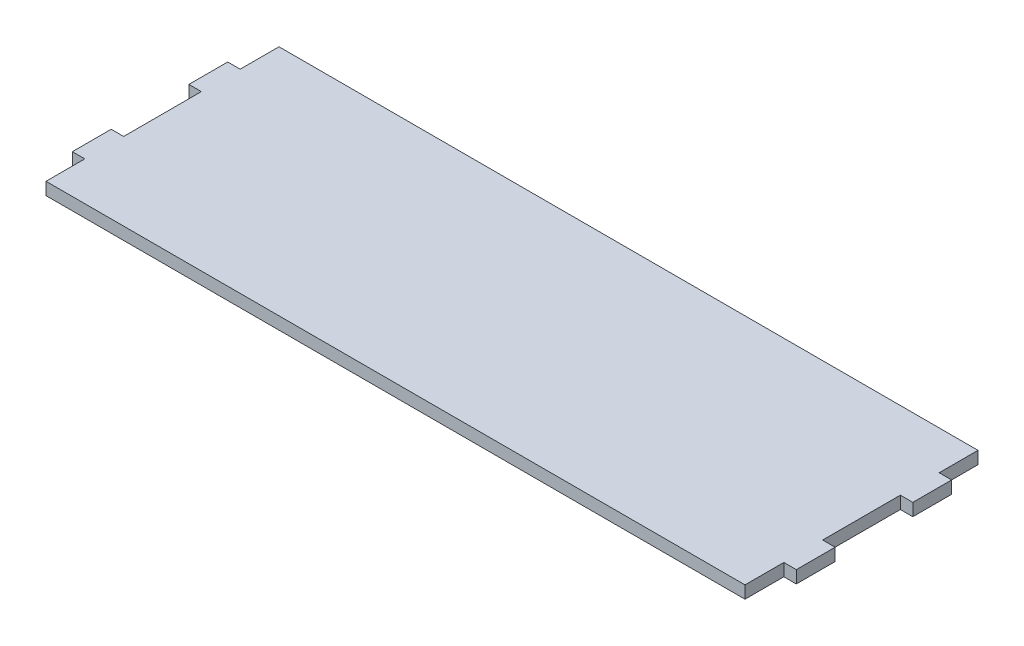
ISO-10303-21;
HEADER;
FILE_DESCRIPTION(('STEP AP214'),'2;1');
FILE_NAME('part.step','',(''),(''),'','','');
FILE_SCHEMA(('AUTOMOTIVE_DESIGN { 1 0 10303 214 1 1 1 1 }'));
ENDSEC;
DATA;
#1=APPLICATION_CONTEXT('core data for automotive mechanical design processes');
#2=APPLICATION_PROTOCOL_DEFINITION('international standard','automotive_design',2000,#1);
#3=PRODUCT_CONTEXT('',#1,'mechanical');
#4=PRODUCT('Part','Part','',(#3));
#5=PRODUCT_RELATED_PRODUCT_CATEGORY('part','',(#4));
#6=PRODUCT_DEFINITION_FORMATION('','',#4);
#7=PRODUCT_DEFINITION_CONTEXT('part definition',#1,'design');
#8=PRODUCT_DEFINITION('design','',#6,#7);
#9=PRODUCT_DEFINITION_SHAPE('','',#8);
#10=(LENGTH_UNIT() NAMED_UNIT(*) SI_UNIT(.MILLI.,.METRE.));
#11=(NAMED_UNIT(*) PLANE_ANGLE_UNIT() SI_UNIT($,.RADIAN.));
#12=(NAMED_UNIT(*) SI_UNIT($,.STERADIAN.) SOLID_ANGLE_UNIT());
#13=UNCERTAINTY_MEASURE_WITH_UNIT(LENGTH_MEASURE(1.E-05),#10,'distance_accuracy_value','');
#14=(GEOMETRIC_REPRESENTATION_CONTEXT(3) GLOBAL_UNCERTAINTY_ASSIGNED_CONTEXT((#13)) GLOBAL_UNIT_ASSIGNED_CONTEXT((#10,
#11,#12)) REPRESENTATION_CONTEXT('',''));
#15=CARTESIAN_POINT('',(0.,0.,0.));
#16=DIRECTION('',(0.,0.,1.));
#17=DIRECTION('',(1.,0.,0.));
#18=AXIS2_PLACEMENT_3D('',#15,#16,#17);
#19=CARTESIAN_POINT('',(-59.3719908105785,16.30000042,-260.123418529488));
#20=DIRECTION('',(1.,0.,0.));
#21=DIRECTION('',(0.,0.,-1.));
#22=AXIS2_PLACEMENT_3D('',#19,#20,#21);
#23=PLANE('',#22);
#24=DIRECTION('',(0.,0.,1.));
#25=VECTOR('',#24,1.);
#26=CARTESIAN_POINT('',(-59.3719908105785,0.,-260.123418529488));
#27=LINE('',#26,#25);
#28=CARTESIAN_POINT('',(-59.3719908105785,0.,-260.123418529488));
#29=VERTEX_POINT('',#28);
#30=CARTESIAN_POINT('',(-59.3719908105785,0.,-209.323418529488));
#31=VERTEX_POINT('',#30);
#32=EDGE_CURVE('E201',#29,#31,#27,.T.);
#33=ORIENTED_EDGE('',*,*,#32,.T.);
#34=DIRECTION('',(0.,-1.,0.));
#35=VECTOR('',#34,1.);
#36=CARTESIAN_POINT('',(-59.3719908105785,16.30000042,-209.323418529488));
#37=LINE('',#36,#35);
#38=CARTESIAN_POINT('',(-59.3719908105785,16.30000042,-209.323418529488));
#39=VERTEX_POINT('',#38);
#40=EDGE_CURVE('E11',#39,#31,#37,.T.);
#41=ORIENTED_EDGE('',*,*,#40,.F.);
#42=DIRECTION('',(0.,0.,1.));
#43=VECTOR('',#42,1.);
#44=CARTESIAN_POINT('',(-59.3719908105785,16.30000042,-260.123418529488));
#45=LINE('',#44,#43);
#46=CARTESIAN_POINT('',(-59.3719908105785,16.30000042,-260.123418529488));
#47=VERTEX_POINT('',#46);
#48=EDGE_CURVE('E239',#47,#39,#45,.T.);
#49=ORIENTED_EDGE('',*,*,#48,.F.);
#50=DIRECTION('',(0.,-1.,0.));
#51=VECTOR('',#50,1.);
#52=CARTESIAN_POINT('',(-59.3719908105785,16.30000042,-260.123418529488));
#53=LINE('',#52,#51);
#54=EDGE_CURVE('E197',#47,#29,#53,.T.);
#55=ORIENTED_EDGE('',*,*,#54,.T.);
#56=EDGE_LOOP('',(#33,#41,#49,#55));
#57=FACE_BOUND('',#56,.T.);
#58=ADVANCED_FACE('F33',(#57),#23,.F.);
#59=CARTESIAN_POINT('',(-59.3719908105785,16.30000042,-209.323418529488));
#60=DIRECTION('',(0.,0.,1.));
#61=DIRECTION('',(1.,0.,0.));
#62=AXIS2_PLACEMENT_3D('',#59,#60,#61);
#63=PLANE('',#62);
#64=DIRECTION('',(-1.,0.,0.));
#65=VECTOR('',#64,1.);
#66=CARTESIAN_POINT('',(-59.3719908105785,0.,-209.323418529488));
#67=LINE('',#66,#65);
#68=CARTESIAN_POINT('',(-75.6719912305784,0.,-209.323418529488));
#69=VERTEX_POINT('',#68);
#70=EDGE_CURVE('E204',#31,#69,#67,.T.);
#71=ORIENTED_EDGE('',*,*,#70,.T.);
#72=DIRECTION('',(0.,-1.,0.));
#73=VECTOR('',#72,1.);
#74=CARTESIAN_POINT('',(-75.6719912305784,16.30000042,-209.323418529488));
#75=LINE('',#74,#73);
#76=CARTESIAN_POINT('',(-75.6719912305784,16.30000042,-209.323418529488));
#77=VERTEX_POINT('',#76);
#78=EDGE_CURVE('E41',#77,#69,#75,.T.);
#79=ORIENTED_EDGE('',*,*,#78,.F.);
#80=DIRECTION('',(-1.,0.,0.));
#81=VECTOR('',#80,1.);
#82=CARTESIAN_POINT('',(-59.3719908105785,16.30000042,-209.323418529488));
#83=LINE('',#82,#81);
#84=EDGE_CURVE('E128',#39,#77,#83,.T.);
#85=ORIENTED_EDGE('',*,*,#84,.F.);
#86=ORIENTED_EDGE('',*,*,#40,.T.);
#87=EDGE_LOOP('',(#71,#79,#85,#86));
#88=FACE_BOUND('',#87,.T.);
#89=ADVANCED_FACE('F357',(#88),#63,.F.);
#90=CARTESIAN_POINT('',(-75.6719912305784,16.30000042,-209.323418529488));
#91=DIRECTION('',(1.,0.,0.));
#92=DIRECTION('',(0.,0.,-1.));
#93=AXIS2_PLACEMENT_3D('',#90,#91,#92);
#94=PLANE('',#93);
#95=DIRECTION('',(0.,0.,1.));
#96=VECTOR('',#95,1.);
#97=CARTESIAN_POINT('',(-75.6719912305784,0.,-209.323418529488));
#98=LINE('',#97,#96);
#99=CARTESIAN_POINT('',(-75.6719912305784,0.,-158.523418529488));
#100=VERTEX_POINT('',#99);
#101=EDGE_CURVE('E206',#69,#100,#98,.T.);
#102=ORIENTED_EDGE('',*,*,#101,.T.);
#103=DIRECTION('',(0.,-1.,0.));
#104=VECTOR('',#103,1.);
#105=CARTESIAN_POINT('',(-75.6719912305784,16.30000042,-158.523418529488));
#106=LINE('',#105,#104);
#107=CARTESIAN_POINT('',(-75.6719912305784,16.30000042,-158.523418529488));
#108=VERTEX_POINT('',#107);
#109=EDGE_CURVE('E282',#108,#100,#106,.T.);
#110=ORIENTED_EDGE('',*,*,#109,.F.);
#111=DIRECTION('',(0.,0.,1.));
#112=VECTOR('',#111,1.);
#113=CARTESIAN_POINT('',(-75.6719912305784,16.30000042,-209.323418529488));
#114=LINE('',#113,#112);
#115=EDGE_CURVE('E290',#77,#108,#114,.T.);
#116=ORIENTED_EDGE('',*,*,#115,.F.);
#117=ORIENTED_EDGE('',*,*,#78,.T.);
#118=EDGE_LOOP('',(#102,#110,#116,#117));
#119=FACE_BOUND('',#118,.T.);
#120=ADVANCED_FACE('F288',(#119),#94,.F.);
#121=CARTESIAN_POINT('',(-75.6719912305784,16.30000042,-158.523418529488));
#122=DIRECTION('',(0.,0.,-1.));
#123=DIRECTION('',(-1.,0.,0.));
#124=AXIS2_PLACEMENT_3D('',#121,#122,#123);
#125=PLANE('',#124);
#126=DIRECTION('',(1.,0.,0.));
#127=VECTOR('',#126,1.);
#128=CARTESIAN_POINT('',(-75.6719912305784,0.,-158.523418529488));
#129=LINE('',#128,#127);
#130=CARTESIAN_POINT('',(-59.3719908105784,0.,-158.523418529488));
#131=VERTEX_POINT('',#130);
#132=EDGE_CURVE('E208',#100,#131,#129,.T.);
#133=ORIENTED_EDGE('',*,*,#132,.T.);
#134=DIRECTION('',(0.,-1.,0.));
#135=VECTOR('',#134,1.);
#136=CARTESIAN_POINT('',(-59.3719908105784,16.30000042,-158.523418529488));
#137=LINE('',#136,#135);
#138=CARTESIAN_POINT('',(-59.3719908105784,16.30000042,-158.523418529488));
#139=VERTEX_POINT('',#138);
#140=EDGE_CURVE('E279',#139,#131,#137,.T.);
#141=ORIENTED_EDGE('',*,*,#140,.F.);
#142=DIRECTION('',(1.,0.,0.));
#143=VECTOR('',#142,1.);
#144=CARTESIAN_POINT('',(-75.6719912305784,16.30000042,-158.523418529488));
#145=LINE('',#144,#143);
#146=EDGE_CURVE('E308',#108,#139,#145,.T.);
#147=ORIENTED_EDGE('',*,*,#146,.F.);
#148=ORIENTED_EDGE('',*,*,#109,.T.);
#149=EDGE_LOOP('',(#133,#141,#147,#148));
#150=FACE_BOUND('',#149,.T.);
#151=ADVANCED_FACE('F299',(#150),#125,.F.);
#152=CARTESIAN_POINT('',(-59.3719908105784,16.30000042,-158.523418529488));
#153=DIRECTION('',(1.,0.,0.));
#154=DIRECTION('',(0.,0.,-1.));
#155=AXIS2_PLACEMENT_3D('',#152,#153,#154);
#156=PLANE('',#155);
#157=DIRECTION('',(0.,0.,1.));
#158=VECTOR('',#157,1.);
#159=CARTESIAN_POINT('',(-59.3719908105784,0.,-158.523418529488));
#160=LINE('',#159,#158);
#161=CARTESIAN_POINT('',(-59.3719908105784,0.,-56.9234185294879));
#162=VERTEX_POINT('',#161);
#163=EDGE_CURVE('E210',#131,#162,#160,.T.);
#164=ORIENTED_EDGE('',*,*,#163,.T.);
#165=DIRECTION('',(0.,-1.,0.));
#166=VECTOR('',#165,1.);
#167=CARTESIAN_POINT('',(-59.3719908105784,16.30000042,-56.9234185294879));
#168=LINE('',#167,#166);
#169=CARTESIAN_POINT('',(-59.3719908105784,16.30000042,-56.9234185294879));
#170=VERTEX_POINT('',#169);
#171=EDGE_CURVE('E276',#170,#162,#168,.T.);
#172=ORIENTED_EDGE('',*,*,#171,.F.);
#173=DIRECTION('',(0.,0.,1.));
#174=VECTOR('',#173,1.);
#175=CARTESIAN_POINT('',(-59.3719908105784,16.30000042,-158.523418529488));
#176=LINE('',#175,#174);
#177=EDGE_CURVE('E305',#139,#170,#176,.T.);
#178=ORIENTED_EDGE('',*,*,#177,.F.);
#179=ORIENTED_EDGE('',*,*,#140,.T.);
#180=EDGE_LOOP('',(#164,#172,#178,#179));
#181=FACE_BOUND('',#180,.T.);
#182=ADVANCED_FACE('F303',(#181),#156,.F.);
#183=CARTESIAN_POINT('',(-75.6719912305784,16.30000042,-56.9234185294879));
#184=DIRECTION('',(0.,0.,1.));
#185=DIRECTION('',(1.,0.,0.));
#186=AXIS2_PLACEMENT_3D('',#183,#184,#185);
#187=PLANE('',#186);
#188=DIRECTION('',(-1.,0.,0.));
#189=VECTOR('',#188,1.);
#190=CARTESIAN_POINT('',(-75.6719912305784,0.,-56.9234185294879));
#191=LINE('',#190,#189);
#192=CARTESIAN_POINT('',(-75.6719912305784,0.,-56.9234185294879));
#193=VERTEX_POINT('',#192);
#194=EDGE_CURVE('E212',#162,#193,#191,.T.);
#195=ORIENTED_EDGE('',*,*,#194,.T.);
#196=DIRECTION('',(0.,-1.,0.));
#197=VECTOR('',#196,1.);
#198=CARTESIAN_POINT('',(-75.6719912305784,16.30000042,-56.9234185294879));
#199=LINE('',#198,#197);
#200=CARTESIAN_POINT('',(-75.6719912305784,16.30000042,-56.9234185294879));
#201=VERTEX_POINT('',#200);
#202=EDGE_CURVE('E273',#201,#193,#199,.T.);
#203=ORIENTED_EDGE('',*,*,#202,.F.);
#204=DIRECTION('',(-1.,0.,0.));
#205=VECTOR('',#204,1.);
#206=CARTESIAN_POINT('',(-75.6719912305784,16.30000042,-56.9234185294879));
#207=LINE('',#206,#205);
#208=EDGE_CURVE('E307',#170,#201,#207,.T.);
#209=ORIENTED_EDGE('',*,*,#208,.F.);
#210=ORIENTED_EDGE('',*,*,#171,.T.);
#211=EDGE_LOOP('',(#195,#203,#209,#210));
#212=FACE_BOUND('',#211,.T.);
#213=ADVANCED_FACE('F370',(#212),#187,.F.);
#214=CARTESIAN_POINT('',(-75.6719912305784,16.30000042,-6.12341852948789));
#215=DIRECTION('',(1.,0.,0.));
#216=DIRECTION('',(0.,0.,-1.));
#217=AXIS2_PLACEMENT_3D('',#214,#215,#216);
#218=PLANE('',#217);
#219=DIRECTION('',(0.,0.,1.));
#220=VECTOR('',#219,1.);
#221=CARTESIAN_POINT('',(-75.6719912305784,0.,-6.12341852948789));
#222=LINE('',#221,#220);
#223=CARTESIAN_POINT('',(-75.6719912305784,0.,-6.12341852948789));
#224=VERTEX_POINT('',#223);
#225=EDGE_CURVE('E214',#193,#224,#222,.T.);
#226=ORIENTED_EDGE('',*,*,#225,.T.);
#227=DIRECTION('',(0.,-1.,0.));
#228=VECTOR('',#227,1.);
#229=CARTESIAN_POINT('',(-75.6719912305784,16.30000042,-6.12341852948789));
#230=LINE('',#229,#228);
#231=CARTESIAN_POINT('',(-75.6719912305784,16.30000042,-6.12341852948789));
#232=VERTEX_POINT('',#231);
#233=EDGE_CURVE('E270',#232,#224,#230,.T.);
#234=ORIENTED_EDGE('',*,*,#233,.F.);
#235=DIRECTION('',(0.,0.,1.));
#236=VECTOR('',#235,1.);
#237=CARTESIAN_POINT('',(-75.6719912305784,16.30000042,-6.12341852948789));
#238=LINE('',#237,#236);
#239=EDGE_CURVE('E310',#201,#232,#238,.T.);
#240=ORIENTED_EDGE('',*,*,#239,.F.);
#241=ORIENTED_EDGE('',*,*,#202,.T.);
#242=EDGE_LOOP('',(#226,#234,#240,#241));
#243=FACE_BOUND('',#242,.T.);
#244=ADVANCED_FACE('F373',(#243),#218,.F.);
#245=CARTESIAN_POINT('',(-59.3719908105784,16.30000042,-6.12341852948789));
#246=DIRECTION('',(0.,0.,-1.));
#247=DIRECTION('',(-1.,0.,0.));
#248=AXIS2_PLACEMENT_3D('',#245,#246,#247);
#249=PLANE('',#248);
#250=DIRECTION('',(1.,0.,0.));
#251=VECTOR('',#250,1.);
#252=CARTESIAN_POINT('',(-59.3719908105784,0.,-6.12341852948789));
#253=LINE('',#252,#251);
#254=CARTESIAN_POINT('',(-59.3719908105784,0.,-6.12341852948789));
#255=VERTEX_POINT('',#254);
#256=EDGE_CURVE('E216',#224,#255,#253,.T.);
#257=ORIENTED_EDGE('',*,*,#256,.T.);
#258=DIRECTION('',(0.,-1.,0.));
#259=VECTOR('',#258,1.);
#260=CARTESIAN_POINT('',(-59.3719908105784,16.30000042,-6.12341852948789));
#261=LINE('',#260,#259);
#262=CARTESIAN_POINT('',(-59.3719908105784,16.30000042,-6.12341852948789));
#263=VERTEX_POINT('',#262);
#264=EDGE_CURVE('E267',#263,#255,#261,.T.);
#265=ORIENTED_EDGE('',*,*,#264,.F.);
#266=DIRECTION('',(1.,0.,0.));
#267=VECTOR('',#266,1.);
#268=CARTESIAN_POINT('',(-59.3719908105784,16.30000042,-6.12341852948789));
#269=LINE('',#268,#267);
#270=EDGE_CURVE('E316',#232,#263,#269,.T.);
#271=ORIENTED_EDGE('',*,*,#270,.F.);
#272=ORIENTED_EDGE('',*,*,#233,.T.);
#273=EDGE_LOOP('',(#257,#265,#271,#272));
#274=FACE_BOUND('',#273,.T.);
#275=ADVANCED_FACE('F377',(#274),#249,.F.);
#276=CARTESIAN_POINT('',(-59.3719908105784,16.30000042,-6.12341852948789));
#277=DIRECTION('',(1.,0.,0.));
#278=DIRECTION('',(0.,0.,-1.));
#279=AXIS2_PLACEMENT_3D('',#276,#277,#278);
#280=PLANE('',#279);
#281=DIRECTION('',(0.,0.,1.));
#282=VECTOR('',#281,1.);
#283=CARTESIAN_POINT('',(-59.3719908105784,0.,-6.12341852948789));
#284=LINE('',#283,#282);
#285=CARTESIAN_POINT('',(-59.3719908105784,0.,44.6765814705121));
#286=VERTEX_POINT('',#285);
#287=EDGE_CURVE('E218',#255,#286,#284,.T.);
#288=ORIENTED_EDGE('',*,*,#287,.T.);
#289=DIRECTION('',(0.,-1.,0.));
#290=VECTOR('',#289,1.);
#291=CARTESIAN_POINT('',(-59.3719908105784,16.30000042,44.6765814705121));
#292=LINE('',#291,#290);
#293=CARTESIAN_POINT('',(-59.3719908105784,16.30000042,44.6765814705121));
#294=VERTEX_POINT('',#293);
#295=EDGE_CURVE('E264',#294,#286,#292,.T.);
#296=ORIENTED_EDGE('',*,*,#295,.F.);
#297=DIRECTION('',(0.,0.,1.));
#298=VECTOR('',#297,1.);
#299=CARTESIAN_POINT('',(-59.3719908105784,16.30000042,-6.12341852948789));
#300=LINE('',#299,#298);
#301=EDGE_CURVE('E318',#263,#294,#300,.T.);
#302=ORIENTED_EDGE('',*,*,#301,.F.);
#303=ORIENTED_EDGE('',*,*,#264,.T.);
#304=EDGE_LOOP('',(#288,#296,#302,#303));
#305=FACE_BOUND('',#304,.T.);
#306=ADVANCED_FACE('F381',(#305),#280,.F.);
#307=CARTESIAN_POINT('',(-59.3719908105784,16.30000042,44.6765814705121));
#308=DIRECTION('',(0.,0.,-1.));
#309=DIRECTION('',(-1.,0.,0.));
#310=AXIS2_PLACEMENT_3D('',#307,#308,#309);
#311=PLANE('',#310);
#312=DIRECTION('',(1.,0.,0.));
#313=VECTOR('',#312,1.);
#314=CARTESIAN_POINT('',(-59.3719908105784,0.,44.6765814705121));
#315=LINE('',#314,#313);
#316=CARTESIAN_POINT('',(855.028009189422,0.,44.6765814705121));
#317=VERTEX_POINT('',#316);
#318=EDGE_CURVE('E220',#286,#317,#315,.T.);
#319=ORIENTED_EDGE('',*,*,#318,.T.);
#320=DIRECTION('',(0.,-1.,0.));
#321=VECTOR('',#320,1.);
#322=CARTESIAN_POINT('',(855.028009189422,16.30000042,44.6765814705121));
#323=LINE('',#322,#321);
#324=CARTESIAN_POINT('',(855.028009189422,16.30000042,44.6765814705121));
#325=VERTEX_POINT('',#324);
#326=EDGE_CURVE('E261',#325,#317,#323,.T.);
#327=ORIENTED_EDGE('',*,*,#326,.F.);
#328=DIRECTION('',(1.,0.,0.));
#329=VECTOR('',#328,1.);
#330=CARTESIAN_POINT('',(-59.3719908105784,16.30000042,44.6765814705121));
#331=LINE('',#330,#329);
#332=EDGE_CURVE('E320',#294,#325,#331,.T.);
#333=ORIENTED_EDGE('',*,*,#332,.F.);
#334=ORIENTED_EDGE('',*,*,#295,.T.);
#335=EDGE_LOOP('',(#319,#327,#333,#334));
#336=FACE_BOUND('',#335,.T.);
#337=ADVANCED_FACE('F385',(#336),#311,.F.);
#338=CARTESIAN_POINT('',(855.028009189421,16.30000042,-6.123418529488));
#339=DIRECTION('',(-1.,0.,0.));
#340=DIRECTION('',(0.,0.,1.));
#341=AXIS2_PLACEMENT_3D('',#338,#339,#340);
#342=PLANE('',#341);
#343=DIRECTION('',(0.,0.,-1.));
#344=VECTOR('',#343,1.);
#345=CARTESIAN_POINT('',(855.028009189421,0.,-6.123418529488));
#346=LINE('',#345,#344);
#347=CARTESIAN_POINT('',(855.028009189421,0.,-6.123418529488));
#348=VERTEX_POINT('',#347);
#349=EDGE_CURVE('E222',#317,#348,#346,.T.);
#350=ORIENTED_EDGE('',*,*,#349,.T.);
#351=DIRECTION('',(0.,-1.,0.));
#352=VECTOR('',#351,1.);
#353=CARTESIAN_POINT('',(855.028009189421,16.30000042,-6.123418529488));
#354=LINE('',#353,#352);
#355=CARTESIAN_POINT('',(855.028009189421,16.30000042,-6.123418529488));
#356=VERTEX_POINT('',#355);
#357=EDGE_CURVE('E258',#356,#348,#354,.T.);
#358=ORIENTED_EDGE('',*,*,#357,.F.);
#359=DIRECTION('',(0.,0.,-1.));
#360=VECTOR('',#359,1.);
#361=CARTESIAN_POINT('',(855.028009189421,16.30000042,-6.123418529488));
#362=LINE('',#361,#360);
#363=EDGE_CURVE('E322',#325,#356,#362,.T.);
#364=ORIENTED_EDGE('',*,*,#363,.F.);
#365=ORIENTED_EDGE('',*,*,#326,.T.);
#366=EDGE_LOOP('',(#350,#358,#364,#365));
#367=FACE_BOUND('',#366,.T.);
#368=ADVANCED_FACE('F389',(#367),#342,.F.);
#369=CARTESIAN_POINT('',(855.028009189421,16.30000042,-6.123418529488));
#370=DIRECTION('',(0.,0.,-1.));
#371=DIRECTION('',(-1.,0.,0.));
#372=AXIS2_PLACEMENT_3D('',#369,#370,#371);
#373=PLANE('',#372);
#374=DIRECTION('',(1.,0.,0.));
#375=VECTOR('',#374,1.);
#376=CARTESIAN_POINT('',(855.028009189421,0.,-6.123418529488));
#377=LINE('',#376,#375);
#378=CARTESIAN_POINT('',(871.328009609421,0.,-6.123418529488));
#379=VERTEX_POINT('',#378);
#380=EDGE_CURVE('E224',#348,#379,#377,.T.);
#381=ORIENTED_EDGE('',*,*,#380,.T.);
#382=DIRECTION('',(0.,-1.,0.));
#383=VECTOR('',#382,1.);
#384=CARTESIAN_POINT('',(871.328009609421,16.30000042,-6.123418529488));
#385=LINE('',#384,#383);
#386=CARTESIAN_POINT('',(871.328009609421,16.30000042,-6.123418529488));
#387=VERTEX_POINT('',#386);
#388=EDGE_CURVE('E255',#387,#379,#385,.T.);
#389=ORIENTED_EDGE('',*,*,#388,.F.);
#390=DIRECTION('',(1.,0.,0.));
#391=VECTOR('',#390,1.);
#392=CARTESIAN_POINT('',(855.028009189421,16.30000042,-6.123418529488));
#393=LINE('',#392,#391);
#394=EDGE_CURVE('E324',#356,#387,#393,.T.);
#395=ORIENTED_EDGE('',*,*,#394,.F.);
#396=ORIENTED_EDGE('',*,*,#357,.T.);
#397=EDGE_LOOP('',(#381,#389,#395,#396));
#398=FACE_BOUND('',#397,.T.);
#399=ADVANCED_FACE('F393',(#398),#373,.F.);
#400=CARTESIAN_POINT('',(871.328009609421,16.30000042,-6.123418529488));
#401=DIRECTION('',(-1.,0.,0.));
#402=DIRECTION('',(0.,0.,1.));
#403=AXIS2_PLACEMENT_3D('',#400,#401,#402);
#404=PLANE('',#403);
#405=DIRECTION('',(0.,0.,-1.));
#406=VECTOR('',#405,1.);
#407=CARTESIAN_POINT('',(871.328009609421,0.,-6.123418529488));
#408=LINE('',#407,#406);
#409=CARTESIAN_POINT('',(871.328009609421,0.,-56.923418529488));
#410=VERTEX_POINT('',#409);
#411=EDGE_CURVE('E226',#379,#410,#408,.T.);
#412=ORIENTED_EDGE('',*,*,#411,.T.);
#413=DIRECTION('',(0.,-1.,0.));
#414=VECTOR('',#413,1.);
#415=CARTESIAN_POINT('',(871.328009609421,16.30000042,-56.923418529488));
#416=LINE('',#415,#414);
#417=CARTESIAN_POINT('',(871.328009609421,16.30000042,-56.923418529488));
#418=VERTEX_POINT('',#417);
#419=EDGE_CURVE('E252',#418,#410,#416,.T.);
#420=ORIENTED_EDGE('',*,*,#419,.F.);
#421=DIRECTION('',(0.,0.,-1.));
#422=VECTOR('',#421,1.);
#423=CARTESIAN_POINT('',(871.328009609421,16.30000042,-6.123418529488));
#424=LINE('',#423,#422);
#425=EDGE_CURVE('E326',#387,#418,#424,.T.);
#426=ORIENTED_EDGE('',*,*,#425,.F.);
#427=ORIENTED_EDGE('',*,*,#388,.T.);
#428=EDGE_LOOP('',(#412,#420,#426,#427));
#429=FACE_BOUND('',#428,.T.);
#430=ADVANCED_FACE('F397',(#429),#404,.F.);
#431=CARTESIAN_POINT('',(871.328009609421,16.30000042,-56.923418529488));
#432=DIRECTION('',(0.,0.,1.));
#433=DIRECTION('',(1.,0.,0.));
#434=AXIS2_PLACEMENT_3D('',#431,#432,#433);
#435=PLANE('',#434);
#436=DIRECTION('',(-1.,0.,0.));
#437=VECTOR('',#436,1.);
#438=CARTESIAN_POINT('',(871.328009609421,0.,-56.923418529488));
#439=LINE('',#438,#437);
#440=CARTESIAN_POINT('',(855.028009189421,0.,-56.923418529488));
#441=VERTEX_POINT('',#440);
#442=EDGE_CURVE('E228',#410,#441,#439,.T.);
#443=ORIENTED_EDGE('',*,*,#442,.T.);
#444=DIRECTION('',(0.,-1.,0.));
#445=VECTOR('',#444,1.);
#446=CARTESIAN_POINT('',(855.028009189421,16.30000042,-56.923418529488));
#447=LINE('',#446,#445);
#448=CARTESIAN_POINT('',(855.028009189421,16.30000042,-56.923418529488));
#449=VERTEX_POINT('',#448);
#450=EDGE_CURVE('E249',#449,#441,#447,.T.);
#451=ORIENTED_EDGE('',*,*,#450,.F.);
#452=DIRECTION('',(-1.,0.,0.));
#453=VECTOR('',#452,1.);
#454=CARTESIAN_POINT('',(871.328009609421,16.30000042,-56.923418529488));
#455=LINE('',#454,#453);
#456=EDGE_CURVE('E328',#418,#449,#455,.T.);
#457=ORIENTED_EDGE('',*,*,#456,.F.);
#458=ORIENTED_EDGE('',*,*,#419,.T.);
#459=EDGE_LOOP('',(#443,#451,#457,#458));
#460=FACE_BOUND('',#459,.T.);
#461=ADVANCED_FACE('F401',(#460),#435,.F.);
#462=CARTESIAN_POINT('',(855.028009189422,16.30000042,-158.523418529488));
#463=DIRECTION('',(-1.,0.,0.));
#464=DIRECTION('',(0.,0.,1.));
#465=AXIS2_PLACEMENT_3D('',#462,#463,#464);
#466=PLANE('',#465);
#467=DIRECTION('',(0.,0.,-1.));
#468=VECTOR('',#467,1.);
#469=CARTESIAN_POINT('',(855.028009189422,0.,-158.523418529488));
#470=LINE('',#469,#468);
#471=CARTESIAN_POINT('',(855.028009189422,0.,-158.523418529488));
#472=VERTEX_POINT('',#471);
#473=EDGE_CURVE('E230',#441,#472,#470,.T.);
#474=ORIENTED_EDGE('',*,*,#473,.T.);
#475=DIRECTION('',(0.,-1.,0.));
#476=VECTOR('',#475,1.);
#477=CARTESIAN_POINT('',(855.028009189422,16.30000042,-158.523418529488));
#478=LINE('',#477,#476);
#479=CARTESIAN_POINT('',(855.028009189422,16.30000042,-158.523418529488));
#480=VERTEX_POINT('',#479);
#481=EDGE_CURVE('E246',#480,#472,#478,.T.);
#482=ORIENTED_EDGE('',*,*,#481,.F.);
#483=DIRECTION('',(0.,0.,-1.));
#484=VECTOR('',#483,1.);
#485=CARTESIAN_POINT('',(855.028009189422,16.30000042,-158.523418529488));
#486=LINE('',#485,#484);
#487=EDGE_CURVE('E330',#449,#480,#486,.T.);
#488=ORIENTED_EDGE('',*,*,#487,.F.);
#489=ORIENTED_EDGE('',*,*,#450,.T.);
#490=EDGE_LOOP('',(#474,#482,#488,#489));
#491=FACE_BOUND('',#490,.T.);
#492=ADVANCED_FACE('F405',(#491),#466,.F.);
#493=CARTESIAN_POINT('',(871.328009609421,16.30000042,-158.523418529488));
#494=DIRECTION('',(0.,0.,-1.));
#495=DIRECTION('',(-1.,0.,0.));
#496=AXIS2_PLACEMENT_3D('',#493,#494,#495);
#497=PLANE('',#496);
#498=DIRECTION('',(1.,0.,0.));
#499=VECTOR('',#498,1.);
#500=CARTESIAN_POINT('',(871.328009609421,0.,-158.523418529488));
#501=LINE('',#500,#499);
#502=CARTESIAN_POINT('',(871.328009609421,0.,-158.523418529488));
#503=VERTEX_POINT('',#502);
#504=EDGE_CURVE('E232',#472,#503,#501,.T.);
#505=ORIENTED_EDGE('',*,*,#504,.T.);
#506=DIRECTION('',(0.,-1.,0.));
#507=VECTOR('',#506,1.);
#508=CARTESIAN_POINT('',(871.328009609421,16.30000042,-158.523418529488));
#509=LINE('',#508,#507);
#510=CARTESIAN_POINT('',(871.328009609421,16.30000042,-158.523418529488));
#511=VERTEX_POINT('',#510);
#512=EDGE_CURVE('E243',#511,#503,#509,.T.);
#513=ORIENTED_EDGE('',*,*,#512,.F.);
#514=DIRECTION('',(1.,0.,0.));
#515=VECTOR('',#514,1.);
#516=CARTESIAN_POINT('',(871.328009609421,16.30000042,-158.523418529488));
#517=LINE('',#516,#515);
#518=EDGE_CURVE('E332',#480,#511,#517,.T.);
#519=ORIENTED_EDGE('',*,*,#518,.F.);
#520=ORIENTED_EDGE('',*,*,#481,.T.);
#521=EDGE_LOOP('',(#505,#513,#519,#520));
#522=FACE_BOUND('',#521,.T.);
#523=ADVANCED_FACE('F338',(#522),#497,.F.);
#524=CARTESIAN_POINT('',(871.328009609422,16.30000042,-209.323418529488));
#525=DIRECTION('',(-1.,0.,0.));
#526=DIRECTION('',(0.,0.,1.));
#527=AXIS2_PLACEMENT_3D('',#524,#525,#526);
#528=PLANE('',#527);
#529=DIRECTION('',(0.,0.,-1.));
#530=VECTOR('',#529,1.);
#531=CARTESIAN_POINT('',(871.328009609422,0.,-209.323418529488));
#532=LINE('',#531,#530);
#533=CARTESIAN_POINT('',(871.328009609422,0.,-209.323418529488));
#534=VERTEX_POINT('',#533);
#535=EDGE_CURVE('E234',#503,#534,#532,.T.);
#536=ORIENTED_EDGE('',*,*,#535,.T.);
#537=DIRECTION('',(0.,-1.,0.));
#538=VECTOR('',#537,1.);
#539=CARTESIAN_POINT('',(871.328009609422,16.30000042,-209.323418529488));
#540=LINE('',#539,#538);
#541=CARTESIAN_POINT('',(871.328009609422,16.30000042,-209.323418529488));
#542=VERTEX_POINT('',#541);
#543=EDGE_CURVE('E192',#542,#534,#540,.T.);
#544=ORIENTED_EDGE('',*,*,#543,.F.);
#545=DIRECTION('',(0.,0.,-1.));
#546=VECTOR('',#545,1.);
#547=CARTESIAN_POINT('',(871.328009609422,16.30000042,-209.323418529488));
#548=LINE('',#547,#546);
#549=EDGE_CURVE('E183',#511,#542,#548,.T.);
#550=ORIENTED_EDGE('',*,*,#549,.F.);
#551=ORIENTED_EDGE('',*,*,#512,.T.);
#552=EDGE_LOOP('',(#536,#544,#550,#551));
#553=FACE_BOUND('',#552,.T.);
#554=ADVANCED_FACE('F342',(#553),#528,.F.);
#555=CARTESIAN_POINT('',(855.028009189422,16.30000042,-209.323418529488));
#556=DIRECTION('',(0.,0.,1.));
#557=DIRECTION('',(1.,0.,0.));
#558=AXIS2_PLACEMENT_3D('',#555,#556,#557);
#559=PLANE('',#558);
#560=DIRECTION('',(-1.,0.,0.));
#561=VECTOR('',#560,1.);
#562=CARTESIAN_POINT('',(855.028009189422,0.,-209.323418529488));
#563=LINE('',#562,#561);
#564=CARTESIAN_POINT('',(855.028009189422,0.,-209.323418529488));
#565=VERTEX_POINT('',#564);
#566=EDGE_CURVE('E191',#534,#565,#563,.T.);
#567=ORIENTED_EDGE('',*,*,#566,.T.);
#568=DIRECTION('',(0.,-1.,0.));
#569=VECTOR('',#568,1.);
#570=CARTESIAN_POINT('',(855.028009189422,16.30000042,-209.323418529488));
#571=LINE('',#570,#569);
#572=CARTESIAN_POINT('',(855.028009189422,16.30000042,-209.323418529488));
#573=VERTEX_POINT('',#572);
#574=EDGE_CURVE('E188',#573,#565,#571,.T.);
#575=ORIENTED_EDGE('',*,*,#574,.F.);
#576=DIRECTION('',(-1.,0.,0.));
#577=VECTOR('',#576,1.);
#578=CARTESIAN_POINT('',(855.028009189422,16.30000042,-209.323418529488));
#579=LINE('',#578,#577);
#580=EDGE_CURVE('E177',#542,#573,#579,.T.);
#581=ORIENTED_EDGE('',*,*,#580,.F.);
#582=ORIENTED_EDGE('',*,*,#543,.T.);
#583=EDGE_LOOP('',(#567,#575,#581,#582));
#584=FACE_BOUND('',#583,.T.);
#585=ADVANCED_FACE('F189',(#584),#559,.F.);
#586=CARTESIAN_POINT('',(855.028009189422,16.30000042,-260.123418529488));
#587=DIRECTION('',(-1.,0.,0.));
#588=DIRECTION('',(0.,0.,1.));
#589=AXIS2_PLACEMENT_3D('',#586,#587,#588);
#590=PLANE('',#589);
#591=DIRECTION('',(0.,0.,-1.));
#592=VECTOR('',#591,1.);
#593=CARTESIAN_POINT('',(855.028009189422,0.,-260.123418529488));
#594=LINE('',#593,#592);
#595=CARTESIAN_POINT('',(855.028009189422,0.,-260.123418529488));
#596=VERTEX_POINT('',#595);
#597=EDGE_CURVE('E114',#565,#596,#594,.T.);
#598=ORIENTED_EDGE('',*,*,#597,.T.);
#599=DIRECTION('',(0.,-1.,0.));
#600=VECTOR('',#599,1.);
#601=CARTESIAN_POINT('',(855.028009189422,16.30000042,-260.123418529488));
#602=LINE('',#601,#600);
#603=CARTESIAN_POINT('',(855.028009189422,16.30000042,-260.123418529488));
#604=VERTEX_POINT('',#603);
#605=EDGE_CURVE('E193',#604,#596,#602,.T.);
#606=ORIENTED_EDGE('',*,*,#605,.F.);
#607=DIRECTION('',(0.,0.,-1.));
#608=VECTOR('',#607,1.);
#609=CARTESIAN_POINT('',(855.028009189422,16.30000042,-260.123418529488));
#610=LINE('',#609,#608);
#611=EDGE_CURVE('E181',#573,#604,#610,.T.);
#612=ORIENTED_EDGE('',*,*,#611,.F.);
#613=ORIENTED_EDGE('',*,*,#574,.T.);
#614=EDGE_LOOP('',(#598,#606,#612,#613));
#615=FACE_BOUND('',#614,.T.);
#616=ADVANCED_FACE('F195',(#615),#590,.F.);
#617=CARTESIAN_POINT('',(-59.3719908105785,16.30000042,-260.123418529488));
#618=DIRECTION('',(0.,0.,1.));
#619=DIRECTION('',(1.,0.,0.));
#620=AXIS2_PLACEMENT_3D('',#617,#618,#619);
#621=PLANE('',#620);
#622=DIRECTION('',(-1.,0.,0.));
#623=VECTOR('',#622,1.);
#624=CARTESIAN_POINT('',(-59.3719908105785,0.,-260.123418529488));
#625=LINE('',#624,#623);
#626=EDGE_CURVE('E120',#596,#29,#625,.T.);
#627=ORIENTED_EDGE('',*,*,#626,.T.);
#628=ORIENTED_EDGE('',*,*,#54,.F.);
#629=DIRECTION('',(-1.,0.,0.));
#630=VECTOR('',#629,1.);
#631=CARTESIAN_POINT('',(-59.3719908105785,16.30000042,-260.123418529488));
#632=LINE('',#631,#630);
#633=EDGE_CURVE('E49',#604,#47,#632,.T.);
#634=ORIENTED_EDGE('',*,*,#633,.F.);
#635=ORIENTED_EDGE('',*,*,#605,.T.);
#636=EDGE_LOOP('',(#627,#628,#634,#635));
#637=FACE_BOUND('',#636,.T.);
#638=ADVANCED_FACE('F346',(#637),#621,.F.);
#639=CARTESIAN_POINT('',(0.,16.30000042,0.));
#640=DIRECTION('',(0.,-1.,0.));
#641=DIRECTION('',(0.,0.,-1.));
#642=AXIS2_PLACEMENT_3D('',#639,#640,#641);
#643=PLANE('',#642);
#644=ORIENTED_EDGE('',*,*,#48,.T.);
#645=ORIENTED_EDGE('',*,*,#84,.T.);
#646=ORIENTED_EDGE('',*,*,#115,.T.);
#647=ORIENTED_EDGE('',*,*,#146,.T.);
#648=ORIENTED_EDGE('',*,*,#177,.T.);
#649=ORIENTED_EDGE('',*,*,#208,.T.);
#650=ORIENTED_EDGE('',*,*,#239,.T.);
#651=ORIENTED_EDGE('',*,*,#270,.T.);
#652=ORIENTED_EDGE('',*,*,#301,.T.);
#653=ORIENTED_EDGE('',*,*,#332,.T.);
#654=ORIENTED_EDGE('',*,*,#363,.T.);
#655=ORIENTED_EDGE('',*,*,#394,.T.);
#656=ORIENTED_EDGE('',*,*,#425,.T.);
#657=ORIENTED_EDGE('',*,*,#456,.T.);
#658=ORIENTED_EDGE('',*,*,#487,.T.);
#659=ORIENTED_EDGE('',*,*,#518,.T.);
#660=ORIENTED_EDGE('',*,*,#549,.T.);
#661=ORIENTED_EDGE('',*,*,#580,.T.);
#662=ORIENTED_EDGE('',*,*,#611,.T.);
#663=ORIENTED_EDGE('',*,*,#633,.T.);
#664=EDGE_LOOP('',(#644,#645,#646,#647,#648,#649,#650,#651,#652,#653,#654,#655,#656,#657,#658,
#659,#660,#661,#662,#663));
#665=FACE_BOUND('',#664,.T.);
#666=ADVANCED_FACE('F179',(#665),#643,.F.);
#667=CARTESIAN_POINT('',(0.,0.,0.));
#668=DIRECTION('',(0.,-1.,0.));
#669=DIRECTION('',(0.,0.,-1.));
#670=AXIS2_PLACEMENT_3D('',#667,#668,#669);
#671=PLANE('',#670);
#672=ORIENTED_EDGE('',*,*,#32,.F.);
#673=ORIENTED_EDGE('',*,*,#626,.F.);
#674=ORIENTED_EDGE('',*,*,#597,.F.);
#675=ORIENTED_EDGE('',*,*,#566,.F.);
#676=ORIENTED_EDGE('',*,*,#535,.F.);
#677=ORIENTED_EDGE('',*,*,#504,.F.);
#678=ORIENTED_EDGE('',*,*,#473,.F.);
#679=ORIENTED_EDGE('',*,*,#442,.F.);
#680=ORIENTED_EDGE('',*,*,#411,.F.);
#681=ORIENTED_EDGE('',*,*,#380,.F.);
#682=ORIENTED_EDGE('',*,*,#349,.F.);
#683=ORIENTED_EDGE('',*,*,#318,.F.);
#684=ORIENTED_EDGE('',*,*,#287,.F.);
#685=ORIENTED_EDGE('',*,*,#256,.F.);
#686=ORIENTED_EDGE('',*,*,#225,.F.);
#687=ORIENTED_EDGE('',*,*,#194,.F.);
#688=ORIENTED_EDGE('',*,*,#163,.F.);
#689=ORIENTED_EDGE('',*,*,#132,.F.);
#690=ORIENTED_EDGE('',*,*,#101,.F.);
#691=ORIENTED_EDGE('',*,*,#70,.F.);
#692=EDGE_LOOP('',(#672,#673,#674,#675,#676,#677,#678,#679,#680,#681,#682,#683,#684,#685,#686,
#687,#688,#689,#690,#691));
#693=FACE_BOUND('',#692,.T.);
#694=ADVANCED_FACE('F294',(#693),#671,.T.);
#695=CLOSED_SHELL('',(#58,#89,#120,#151,#182,#213,#244,#275,#306,#337,#368,#399,#430,#461,#492,
#523,#554,#585,#616,#638,#666,#694));
#696=MANIFOLD_SOLID_BREP('B2',#695);
#697=ADVANCED_BREP_SHAPE_REPRESENTATION('',(#18,#696),#14);
#698=SHAPE_DEFINITION_REPRESENTATION(#9,#697);
ENDSEC;
END-ISO-10303-21;
